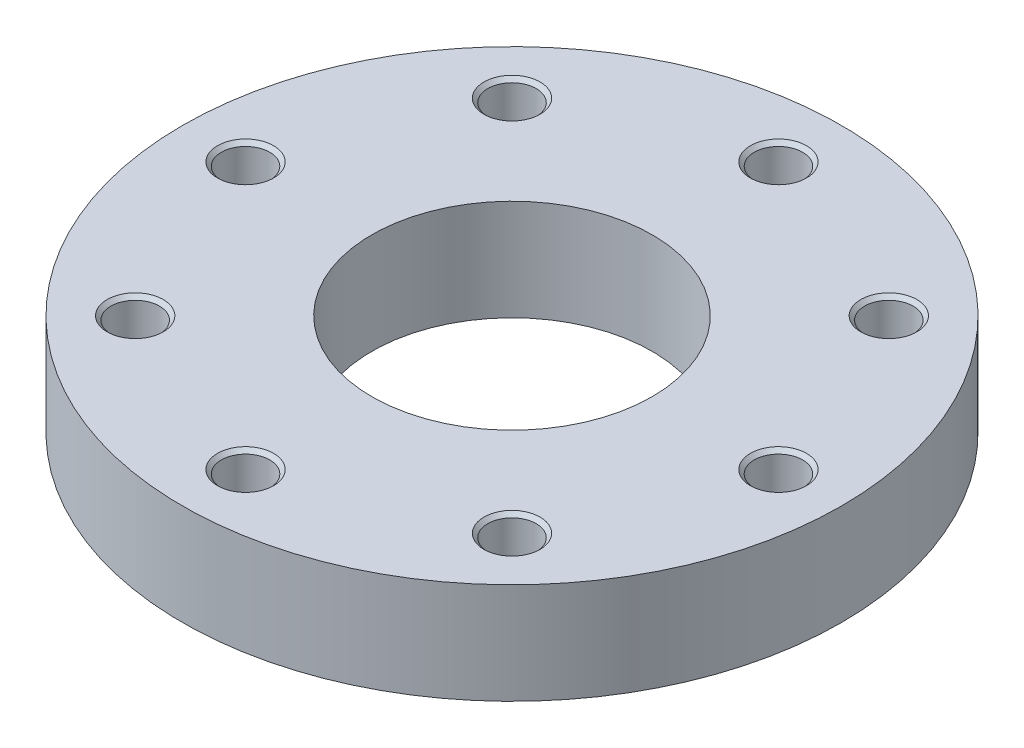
ISO-10303-21;
HEADER;
FILE_DESCRIPTION(('STEP AP214'),'2;1');
FILE_NAME('part.step','',(''),(''),'','','');
FILE_SCHEMA(('AUTOMOTIVE_DESIGN { 1 0 10303 214 1 1 1 1 }'));
ENDSEC;
DATA;
#1=APPLICATION_CONTEXT('core data for automotive mechanical design processes');
#2=APPLICATION_PROTOCOL_DEFINITION('international standard','automotive_design',2000,#1);
#3=PRODUCT_CONTEXT('',#1,'mechanical');
#4=PRODUCT('Part','Part','',(#3));
#5=PRODUCT_RELATED_PRODUCT_CATEGORY('part','',(#4));
#6=PRODUCT_DEFINITION_FORMATION('','',#4);
#7=PRODUCT_DEFINITION_CONTEXT('part definition',#1,'design');
#8=PRODUCT_DEFINITION('design','',#6,#7);
#9=PRODUCT_DEFINITION_SHAPE('','',#8);
#10=(LENGTH_UNIT() NAMED_UNIT(*) SI_UNIT(.MILLI.,.METRE.));
#11=(NAMED_UNIT(*) PLANE_ANGLE_UNIT() SI_UNIT($,.RADIAN.));
#12=(NAMED_UNIT(*) SI_UNIT($,.STERADIAN.) SOLID_ANGLE_UNIT());
#13=UNCERTAINTY_MEASURE_WITH_UNIT(LENGTH_MEASURE(1.E-05),#10,'distance_accuracy_value','');
#14=(GEOMETRIC_REPRESENTATION_CONTEXT(3) GLOBAL_UNCERTAINTY_ASSIGNED_CONTEXT((#13)) GLOBAL_UNIT_ASSIGNED_CONTEXT((#10,
#11,#12)) REPRESENTATION_CONTEXT('',''));
#15=CARTESIAN_POINT('',(0.,0.,0.));
#16=DIRECTION('',(0.,0.,1.));
#17=DIRECTION('',(1.,0.,0.));
#18=AXIS2_PLACEMENT_3D('',#15,#16,#17);
#19=CARTESIAN_POINT('',(0.,18.,0.));
#20=DIRECTION('',(0.,-1.,0.));
#21=DIRECTION('',(1.,0.,0.));
#22=AXIS2_PLACEMENT_3D('',#19,#20,#21);
#23=CYLINDRICAL_SURFACE('',#22,117.5);
#24=CARTESIAN_POINT('',(0.,0.,0.));
#25=DIRECTION('',(0.,1.,0.));
#26=DIRECTION('',(1.,0.,0.));
#27=AXIS2_PLACEMENT_3D('',#24,#25,#26);
#28=CIRCLE('',#27,117.5);
#29=CARTESIAN_POINT('',(117.5,0.,0.));
#30=VERTEX_POINT('',#29);
#31=EDGE_CURVE('E9',#30,#30,#28,.T.);
#32=ORIENTED_EDGE('',*,*,#31,.T.);
#33=EDGE_LOOP('',(#32));
#34=FACE_BOUND('',#33,.T.);
#35=CARTESIAN_POINT('',(0.,36.,0.));
#36=DIRECTION('',(0.,1.,0.));
#37=DIRECTION('',(1.,0.,0.));
#38=AXIS2_PLACEMENT_3D('',#35,#36,#37);
#39=CIRCLE('',#38,117.5);
#40=CARTESIAN_POINT('',(117.5,36.,0.));
#41=VERTEX_POINT('',#40);
#42=EDGE_CURVE('E233',#41,#41,#39,.T.);
#43=ORIENTED_EDGE('',*,*,#42,.F.);
#44=EDGE_LOOP('',(#43));
#45=FACE_BOUND('',#44,.T.);
#46=ADVANCED_FACE('F15',(#34,#45),#23,.T.);
#47=CARTESIAN_POINT('',(83.75,0.,0.));
#48=DIRECTION('',(0.,-1.,0.));
#49=DIRECTION('',(-1.,0.,0.));
#50=AXIS2_PLACEMENT_3D('',#47,#48,#49);
#51=PLANE('',#50);
#52=CARTESIAN_POINT('',(0.,0.,0.));
#53=DIRECTION('',(0.,1.,0.));
#54=DIRECTION('',(1.,0.,0.));
#55=AXIS2_PLACEMENT_3D('',#52,#53,#54);
#56=CIRCLE('',#55,50.);
#57=CARTESIAN_POINT('',(50.,0.,0.));
#58=VERTEX_POINT('',#57);
#59=EDGE_CURVE('E22',#58,#58,#56,.T.);
#60=ORIENTED_EDGE('',*,*,#59,.T.);
#61=EDGE_LOOP('',(#60));
#62=FACE_BOUND('',#61,.T.);
#63=ORIENTED_EDGE('',*,*,#31,.F.);
#64=EDGE_LOOP('',(#63));
#65=FACE_BOUND('',#64,.T.);
#66=ADVANCED_FACE('F225',(#62,#65),#51,.T.);
#67=CARTESIAN_POINT('',(0.,18.,0.));
#68=DIRECTION('',(0.,-1.,0.));
#69=DIRECTION('',(1.,0.,0.));
#70=AXIS2_PLACEMENT_3D('',#67,#68,#69);
#71=CYLINDRICAL_SURFACE('',#70,50.);
#72=CARTESIAN_POINT('',(0.,36.,0.));
#73=DIRECTION('',(0.,1.,0.));
#74=DIRECTION('',(1.,0.,0.));
#75=AXIS2_PLACEMENT_3D('',#72,#73,#74);
#76=CIRCLE('',#75,50.);
#77=CARTESIAN_POINT('',(50.,36.,0.));
#78=VERTEX_POINT('',#77);
#79=EDGE_CURVE('E235',#78,#78,#76,.T.);
#80=ORIENTED_EDGE('',*,*,#79,.T.);
#81=EDGE_LOOP('',(#80));
#82=FACE_BOUND('',#81,.T.);
#83=ORIENTED_EDGE('',*,*,#59,.F.);
#84=EDGE_LOOP('',(#83));
#85=FACE_BOUND('',#84,.T.);
#86=ADVANCED_FACE('F229',(#82,#85),#71,.F.);
#87=CARTESIAN_POINT('',(83.75,36.,0.));
#88=DIRECTION('',(0.,1.,0.));
#89=DIRECTION('',(1.,0.,0.));
#90=AXIS2_PLACEMENT_3D('',#87,#88,#89);
#91=PLANE('',#90);
#92=ORIENTED_EDGE('',*,*,#42,.T.);
#93=EDGE_LOOP('',(#92));
#94=FACE_BOUND('',#93,.T.);
#95=ORIENTED_EDGE('',*,*,#79,.F.);
#96=EDGE_LOOP('',(#95));
#97=FACE_BOUND('',#96,.T.);
#98=CARTESIAN_POINT('',(95.,36.,0.));
#99=DIRECTION('',(0.,-1.,0.));
#100=DIRECTION('',(1.,0.,0.));
#101=AXIS2_PLACEMENT_3D('',#98,#99,#100);
#102=CIRCLE('',#101,10.);
#103=CARTESIAN_POINT('',(105.,36.,0.));
#104=VERTEX_POINT('',#103);
#105=EDGE_CURVE('E245',#104,#104,#102,.T.);
#106=ORIENTED_EDGE('',*,*,#105,.T.);
#107=EDGE_LOOP('',(#106));
#108=FACE_BOUND('',#107,.T.);
#109=CARTESIAN_POINT('',(67.175144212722,36.,-67.175144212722));
#110=DIRECTION('',(0.,-1.,0.));
#111=DIRECTION('',(0.707106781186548,0.,-0.707106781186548));
#112=AXIS2_PLACEMENT_3D('',#109,#110,#111);
#113=CIRCLE('',#112,10.);
#114=CARTESIAN_POINT('',(74.2462120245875,36.,-74.2462120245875));
#115=VERTEX_POINT('',#114);
#116=EDGE_CURVE('E257',#115,#115,#113,.T.);
#117=ORIENTED_EDGE('',*,*,#116,.T.);
#118=EDGE_LOOP('',(#117));
#119=FACE_BOUND('',#118,.T.);
#120=CARTESIAN_POINT('',(0.,36.,-95.));
#121=DIRECTION('',(0.,-1.,0.));
#122=DIRECTION('',(0.,0.,-1.));
#123=AXIS2_PLACEMENT_3D('',#120,#121,#122);
#124=CIRCLE('',#123,10.);
#125=CARTESIAN_POINT('',(0.,36.,-105.));
#126=VERTEX_POINT('',#125);
#127=EDGE_CURVE('E268',#126,#126,#124,.T.);
#128=ORIENTED_EDGE('',*,*,#127,.T.);
#129=EDGE_LOOP('',(#128));
#130=FACE_BOUND('',#129,.T.);
#131=CARTESIAN_POINT('',(-67.175144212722,36.,-67.175144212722));
#132=DIRECTION('',(0.,-1.,0.));
#133=DIRECTION('',(-0.707106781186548,0.,-0.707106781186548));
#134=AXIS2_PLACEMENT_3D('',#131,#132,#133);
#135=CIRCLE('',#134,10.);
#136=CARTESIAN_POINT('',(-74.2462120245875,36.,-74.2462120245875));
#137=VERTEX_POINT('',#136);
#138=EDGE_CURVE('E281',#137,#137,#135,.T.);
#139=ORIENTED_EDGE('',*,*,#138,.T.);
#140=EDGE_LOOP('',(#139));
#141=FACE_BOUND('',#140,.T.);
#142=CARTESIAN_POINT('',(-95.,36.,0.));
#143=DIRECTION('',(0.,-1.,0.));
#144=DIRECTION('',(-1.,0.,0.));
#145=AXIS2_PLACEMENT_3D('',#142,#143,#144);
#146=CIRCLE('',#145,10.);
#147=CARTESIAN_POINT('',(-105.,36.,0.));
#148=VERTEX_POINT('',#147);
#149=EDGE_CURVE('E292',#148,#148,#146,.T.);
#150=ORIENTED_EDGE('',*,*,#149,.T.);
#151=EDGE_LOOP('',(#150));
#152=FACE_BOUND('',#151,.T.);
#153=CARTESIAN_POINT('',(-67.175144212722,36.,67.175144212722));
#154=DIRECTION('',(0.,-1.,0.));
#155=DIRECTION('',(-0.707106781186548,0.,0.707106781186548));
#156=AXIS2_PLACEMENT_3D('',#153,#154,#155);
#157=CIRCLE('',#156,10.);
#158=CARTESIAN_POINT('',(-74.2462120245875,36.,74.2462120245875));
#159=VERTEX_POINT('',#158);
#160=EDGE_CURVE('E315',#159,#159,#157,.T.);
#161=ORIENTED_EDGE('',*,*,#160,.T.);
#162=EDGE_LOOP('',(#161));
#163=FACE_BOUND('',#162,.T.);
#164=CARTESIAN_POINT('',(0.,36.,95.));
#165=DIRECTION('',(0.,-1.,0.));
#166=DIRECTION('',(0.,0.,1.));
#167=AXIS2_PLACEMENT_3D('',#164,#165,#166);
#168=CIRCLE('',#167,10.);
#169=CARTESIAN_POINT('',(0.,36.,105.));
#170=VERTEX_POINT('',#169);
#171=EDGE_CURVE('E310',#170,#170,#168,.T.);
#172=ORIENTED_EDGE('',*,*,#171,.T.);
#173=EDGE_LOOP('',(#172));
#174=FACE_BOUND('',#173,.T.);
#175=CARTESIAN_POINT('',(67.175144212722,36.,67.175144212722));
#176=DIRECTION('',(0.,-1.,0.));
#177=DIRECTION('',(0.707106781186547,0.,0.707106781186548));
#178=AXIS2_PLACEMENT_3D('',#175,#176,#177);
#179=CIRCLE('',#178,10.);
#180=CARTESIAN_POINT('',(74.2462120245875,36.,74.2462120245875));
#181=VERTEX_POINT('',#180);
#182=EDGE_CURVE('E327',#181,#181,#179,.T.);
#183=ORIENTED_EDGE('',*,*,#182,.T.);
#184=EDGE_LOOP('',(#183));
#185=FACE_BOUND('',#184,.T.);
#186=ADVANCED_FACE('F336',(#94,#97,#108,#119,#130,#141,#152,#163,#174,#185),#91,.T.);
#187=CARTESIAN_POINT('',(95.,5.50386219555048,0.));
#188=DIRECTION('',(0.,1.,0.));
#189=DIRECTION('',(1.,0.,0.));
#190=AXIS2_PLACEMENT_3D('',#187,#188,#189);
#191=CONICAL_SURFACE('',#190,4.3234375,1.0471975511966);
#192=CARTESIAN_POINT('',(95.,8.,0.));
#193=DIRECTION('',(0.,-1.,0.));
#194=DIRECTION('',(1.,0.,0.));
#195=AXIS2_PLACEMENT_3D('',#192,#193,#194);
#196=CIRCLE('',#195,8.646875);
#197=CARTESIAN_POINT('',(103.646875,8.,0.));
#198=VERTEX_POINT('',#197);
#199=EDGE_CURVE('E237',#198,#198,#196,.T.);
#200=ORIENTED_EDGE('',*,*,#199,.F.);
#201=EDGE_LOOP('',(#200));
#202=FACE_BOUND('',#201,.T.);
#203=CARTESIAN_POINT('',(95.,3.00772439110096,0.));
#204=VERTEX_POINT('',#203);
#205=VERTEX_LOOP('',#204);
#206=FACE_BOUND('',#205,.T.);
#207=ADVANCED_FACE('F395',(#202,#206),#191,.F.);
#208=CARTESIAN_POINT('',(95.,11.3234375,0.));
#209=DIRECTION('',(0.,1.,0.));
#210=DIRECTION('',(1.,0.,0.));
#211=AXIS2_PLACEMENT_3D('',#208,#209,#210);
#212=CYLINDRICAL_SURFACE('',#211,8.646875);
#213=CARTESIAN_POINT('',(95.,14.646875,0.));
#214=DIRECTION('',(0.,-1.,0.));
#215=DIRECTION('',(1.,0.,0.));
#216=AXIS2_PLACEMENT_3D('',#213,#214,#215);
#217=CIRCLE('',#216,8.646875);
#218=CARTESIAN_POINT('',(103.646875,14.646875,0.));
#219=VERTEX_POINT('',#218);
#220=EDGE_CURVE('E241',#219,#219,#217,.T.);
#221=ORIENTED_EDGE('',*,*,#220,.F.);
#222=EDGE_LOOP('',(#221));
#223=FACE_BOUND('',#222,.T.);
#224=ORIENTED_EDGE('',*,*,#199,.T.);
#225=EDGE_LOOP('',(#224));
#226=FACE_BOUND('',#225,.T.);
#227=ADVANCED_FACE('F392',(#223,#226),#212,.F.);
#228=CARTESIAN_POINT('',(95.,15.3234375,0.));
#229=DIRECTION('',(0.,1.,0.));
#230=DIRECTION('',(1.,0.,0.));
#231=AXIS2_PLACEMENT_3D('',#228,#229,#230);
#232=CONICAL_SURFACE('',#231,9.3234375,0.785398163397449);
#233=CARTESIAN_POINT('',(95.,16.,0.));
#234=DIRECTION('',(0.,-1.,0.));
#235=DIRECTION('',(1.,0.,0.));
#236=AXIS2_PLACEMENT_3D('',#233,#234,#235);
#237=CIRCLE('',#236,10.);
#238=CARTESIAN_POINT('',(105.,16.,0.));
#239=VERTEX_POINT('',#238);
#240=EDGE_CURVE('E242',#239,#239,#237,.T.);
#241=ORIENTED_EDGE('',*,*,#240,.F.);
#242=EDGE_LOOP('',(#241));
#243=FACE_BOUND('',#242,.T.);
#244=ORIENTED_EDGE('',*,*,#220,.T.);
#245=EDGE_LOOP('',(#244));
#246=FACE_BOUND('',#245,.T.);
#247=ADVANCED_FACE('F388',(#243,#246),#232,.F.);
#248=CARTESIAN_POINT('',(104.3234375,16.,0.));
#249=DIRECTION('',(0.,1.,0.));
#250=DIRECTION('',(-1.,0.,0.));
#251=AXIS2_PLACEMENT_3D('',#248,#249,#250);
#252=PLANE('',#251);
#253=CARTESIAN_POINT('',(95.,16.,0.));
#254=DIRECTION('',(0.,-1.,0.));
#255=DIRECTION('',(1.,0.,0.));
#256=AXIS2_PLACEMENT_3D('',#253,#254,#255);
#257=CIRCLE('',#256,8.646875);
#258=CARTESIAN_POINT('',(103.646875,16.,0.));
#259=VERTEX_POINT('',#258);
#260=EDGE_CURVE('E244',#259,#259,#257,.T.);
#261=ORIENTED_EDGE('',*,*,#260,.F.);
#262=EDGE_LOOP('',(#261));
#263=FACE_BOUND('',#262,.T.);
#264=ORIENTED_EDGE('',*,*,#240,.T.);
#265=EDGE_LOOP('',(#264));
#266=FACE_BOUND('',#265,.T.);
#267=ADVANCED_FACE('F384',(#263,#266),#252,.F.);
#268=CARTESIAN_POINT('',(95.,25.3234375,0.));
#269=DIRECTION('',(0.,1.,0.));
#270=DIRECTION('',(1.,0.,0.));
#271=AXIS2_PLACEMENT_3D('',#268,#269,#270);
#272=CYLINDRICAL_SURFACE('',#271,8.646875);
#273=CARTESIAN_POINT('',(95.,34.646875,0.));
#274=DIRECTION('',(0.,-1.,0.));
#275=DIRECTION('',(1.,0.,0.));
#276=AXIS2_PLACEMENT_3D('',#273,#274,#275);
#277=CIRCLE('',#276,8.646875);
#278=CARTESIAN_POINT('',(103.646875,34.646875,0.));
#279=VERTEX_POINT('',#278);
#280=EDGE_CURVE('E247',#279,#279,#277,.T.);
#281=ORIENTED_EDGE('',*,*,#280,.F.);
#282=EDGE_LOOP('',(#281));
#283=FACE_BOUND('',#282,.T.);
#284=ORIENTED_EDGE('',*,*,#260,.T.);
#285=EDGE_LOOP('',(#284));
#286=FACE_BOUND('',#285,.T.);
#287=ADVANCED_FACE('F378',(#283,#286),#272,.F.);
#288=CARTESIAN_POINT('',(95.,35.3234375,0.));
#289=DIRECTION('',(0.,1.,0.));
#290=DIRECTION('',(1.,0.,0.));
#291=AXIS2_PLACEMENT_3D('',#288,#289,#290);
#292=CONICAL_SURFACE('',#291,9.3234375,0.785398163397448);
#293=ORIENTED_EDGE('',*,*,#105,.F.);
#294=EDGE_LOOP('',(#293));
#295=FACE_BOUND('',#294,.T.);
#296=ORIENTED_EDGE('',*,*,#280,.T.);
#297=EDGE_LOOP('',(#296));
#298=FACE_BOUND('',#297,.T.);
#299=ADVANCED_FACE('F373',(#295,#298),#292,.F.);
#300=CARTESIAN_POINT('',(67.175144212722,5.50386219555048,-67.175144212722));
#301=DIRECTION('',(0.,1.,0.));
#302=DIRECTION('',(0.707106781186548,0.,-0.707106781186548));
#303=AXIS2_PLACEMENT_3D('',#300,#301,#302);
#304=CONICAL_SURFACE('',#303,4.3234375,1.0471975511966);
#305=CARTESIAN_POINT('',(67.175144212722,8.,-67.175144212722));
#306=DIRECTION('',(0.,-1.,0.));
#307=DIRECTION('',(0.707106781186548,0.,-0.707106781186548));
#308=AXIS2_PLACEMENT_3D('',#305,#306,#307);
#309=CIRCLE('',#308,8.646875);
#310=CARTESIAN_POINT('',(73.2894081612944,8.,-73.2894081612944));
#311=VERTEX_POINT('',#310);
#312=EDGE_CURVE('E249',#311,#311,#309,.T.);
#313=ORIENTED_EDGE('',*,*,#312,.F.);
#314=EDGE_LOOP('',(#313));
#315=FACE_BOUND('',#314,.T.);
#316=CARTESIAN_POINT('',(67.175144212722,3.00772439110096,-67.175144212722));
#317=VERTEX_POINT('',#316);
#318=VERTEX_LOOP('',#317);
#319=FACE_BOUND('',#318,.T.);
#320=ADVANCED_FACE('F367',(#315,#319),#304,.F.);
#321=CARTESIAN_POINT('',(67.175144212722,11.3234375,-67.175144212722));
#322=DIRECTION('',(0.,1.,0.));
#323=DIRECTION('',(0.707106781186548,0.,-0.707106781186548));
#324=AXIS2_PLACEMENT_3D('',#321,#322,#323);
#325=CYLINDRICAL_SURFACE('',#324,8.646875);
#326=CARTESIAN_POINT('',(67.175144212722,14.646875,-67.175144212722));
#327=DIRECTION('',(0.,-1.,0.));
#328=DIRECTION('',(0.707106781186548,0.,-0.707106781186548));
#329=AXIS2_PLACEMENT_3D('',#326,#327,#328);
#330=CIRCLE('',#329,8.646875);
#331=CARTESIAN_POINT('',(73.2894081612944,14.646875,-73.2894081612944));
#332=VERTEX_POINT('',#331);
#333=EDGE_CURVE('E251',#332,#332,#330,.T.);
#334=ORIENTED_EDGE('',*,*,#333,.F.);
#335=EDGE_LOOP('',(#334));
#336=FACE_BOUND('',#335,.T.);
#337=ORIENTED_EDGE('',*,*,#312,.T.);
#338=EDGE_LOOP('',(#337));
#339=FACE_BOUND('',#338,.T.);
#340=ADVANCED_FACE('F361',(#336,#339),#325,.F.);
#341=CARTESIAN_POINT('',(67.175144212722,15.3234375,-67.175144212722));
#342=DIRECTION('',(0.,1.,0.));
#343=DIRECTION('',(0.707106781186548,0.,-0.707106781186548));
#344=AXIS2_PLACEMENT_3D('',#341,#342,#343);
#345=CONICAL_SURFACE('',#344,9.3234375,0.785398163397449);
#346=CARTESIAN_POINT('',(67.175144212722,16.,-67.175144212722));
#347=DIRECTION('',(0.,-1.,0.));
#348=DIRECTION('',(0.707106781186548,0.,-0.707106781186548));
#349=AXIS2_PLACEMENT_3D('',#346,#347,#348);
#350=CIRCLE('',#349,10.);
#351=CARTESIAN_POINT('',(74.2462120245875,16.,-74.2462120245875));
#352=VERTEX_POINT('',#351);
#353=EDGE_CURVE('E253',#352,#352,#350,.T.);
#354=ORIENTED_EDGE('',*,*,#353,.F.);
#355=EDGE_LOOP('',(#354));
#356=FACE_BOUND('',#355,.T.);
#357=ORIENTED_EDGE('',*,*,#333,.T.);
#358=EDGE_LOOP('',(#357));
#359=FACE_BOUND('',#358,.T.);
#360=ADVANCED_FACE('F355',(#356,#359),#345,.F.);
#361=CARTESIAN_POINT('',(73.767810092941,16.,-73.767810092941));
#362=DIRECTION('',(0.,1.,0.));
#363=DIRECTION('',(-0.707106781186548,0.,0.707106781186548));
#364=AXIS2_PLACEMENT_3D('',#361,#362,#363);
#365=PLANE('',#364);
#366=CARTESIAN_POINT('',(67.175144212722,16.,-67.175144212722));
#367=DIRECTION('',(0.,-1.,0.));
#368=DIRECTION('',(0.707106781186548,0.,-0.707106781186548));
#369=AXIS2_PLACEMENT_3D('',#366,#367,#368);
#370=CIRCLE('',#369,8.646875);
#371=CARTESIAN_POINT('',(73.2894081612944,16.,-73.2894081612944));
#372=VERTEX_POINT('',#371);
#373=EDGE_CURVE('E255',#372,#372,#370,.T.);
#374=ORIENTED_EDGE('',*,*,#373,.F.);
#375=EDGE_LOOP('',(#374));
#376=FACE_BOUND('',#375,.T.);
#377=ORIENTED_EDGE('',*,*,#353,.T.);
#378=EDGE_LOOP('',(#377));
#379=FACE_BOUND('',#378,.T.);
#380=ADVANCED_FACE('F349',(#376,#379),#365,.F.);
#381=CARTESIAN_POINT('',(67.175144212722,25.3234375,-67.175144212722));
#382=DIRECTION('',(0.,1.,0.));
#383=DIRECTION('',(0.707106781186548,0.,-0.707106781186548));
#384=AXIS2_PLACEMENT_3D('',#381,#382,#383);
#385=CYLINDRICAL_SURFACE('',#384,8.646875);
#386=CARTESIAN_POINT('',(67.175144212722,34.646875,-67.175144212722));
#387=DIRECTION('',(0.,-1.,0.));
#388=DIRECTION('',(0.707106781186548,0.,-0.707106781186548));
#389=AXIS2_PLACEMENT_3D('',#386,#387,#388);
#390=CIRCLE('',#389,8.646875);
#391=CARTESIAN_POINT('',(73.2894081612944,34.646875,-73.2894081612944));
#392=VERTEX_POINT('',#391);
#393=EDGE_CURVE('E258',#392,#392,#390,.T.);
#394=ORIENTED_EDGE('',*,*,#393,.F.);
#395=EDGE_LOOP('',(#394));
#396=FACE_BOUND('',#395,.T.);
#397=ORIENTED_EDGE('',*,*,#373,.T.);
#398=EDGE_LOOP('',(#397));
#399=FACE_BOUND('',#398,.T.);
#400=ADVANCED_FACE('F343',(#396,#399),#385,.F.);
#401=CARTESIAN_POINT('',(67.175144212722,35.3234375,-67.175144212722));
#402=DIRECTION('',(0.,1.,0.));
#403=DIRECTION('',(0.707106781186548,0.,-0.707106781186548));
#404=AXIS2_PLACEMENT_3D('',#401,#402,#403);
#405=CONICAL_SURFACE('',#404,9.3234375,0.785398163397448);
#406=ORIENTED_EDGE('',*,*,#116,.F.);
#407=EDGE_LOOP('',(#406));
#408=FACE_BOUND('',#407,.T.);
#409=ORIENTED_EDGE('',*,*,#393,.T.);
#410=EDGE_LOOP('',(#409));
#411=FACE_BOUND('',#410,.T.);
#412=ADVANCED_FACE('F339',(#408,#411),#405,.F.);
#413=CARTESIAN_POINT('',(0.,5.50386219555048,-95.));
#414=DIRECTION('',(0.,1.,0.));
#415=DIRECTION('',(0.,0.,-1.));
#416=AXIS2_PLACEMENT_3D('',#413,#414,#415);
#417=CONICAL_SURFACE('',#416,4.3234375,1.0471975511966);
#418=CARTESIAN_POINT('',(0.,8.,-95.));
#419=DIRECTION('',(0.,-1.,0.));
#420=DIRECTION('',(0.,0.,-1.));
#421=AXIS2_PLACEMENT_3D('',#418,#419,#420);
#422=CIRCLE('',#421,8.646875);
#423=CARTESIAN_POINT('',(0.,8.,-103.646875));
#424=VERTEX_POINT('',#423);
#425=EDGE_CURVE('E260',#424,#424,#422,.T.);
#426=ORIENTED_EDGE('',*,*,#425,.F.);
#427=EDGE_LOOP('',(#426));
#428=FACE_BOUND('',#427,.T.);
#429=CARTESIAN_POINT('',(0.,3.00772439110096,-95.));
#430=VERTEX_POINT('',#429);
#431=VERTEX_LOOP('',#430);
#432=FACE_BOUND('',#431,.T.);
#433=ADVANCED_FACE('F342',(#428,#432),#417,.F.);
#434=CARTESIAN_POINT('',(0.,11.3234375,-95.));
#435=DIRECTION('',(0.,1.,0.));
#436=DIRECTION('',(0.,0.,-1.));
#437=AXIS2_PLACEMENT_3D('',#434,#435,#436);
#438=CYLINDRICAL_SURFACE('',#437,8.646875);
#439=CARTESIAN_POINT('',(0.,14.646875,-95.));
#440=DIRECTION('',(0.,-1.,0.));
#441=DIRECTION('',(0.,0.,-1.));
#442=AXIS2_PLACEMENT_3D('',#439,#440,#441);
#443=CIRCLE('',#442,8.646875);
#444=CARTESIAN_POINT('',(0.,14.646875,-103.646875));
#445=VERTEX_POINT('',#444);
#446=EDGE_CURVE('E262',#445,#445,#443,.T.);
#447=ORIENTED_EDGE('',*,*,#446,.F.);
#448=EDGE_LOOP('',(#447));
#449=FACE_BOUND('',#448,.T.);
#450=ORIENTED_EDGE('',*,*,#425,.T.);
#451=EDGE_LOOP('',(#450));
#452=FACE_BOUND('',#451,.T.);
#453=ADVANCED_FACE('F435',(#449,#452),#438,.F.);
#454=CARTESIAN_POINT('',(0.,15.3234375,-95.));
#455=DIRECTION('',(0.,1.,0.));
#456=DIRECTION('',(0.,0.,-1.));
#457=AXIS2_PLACEMENT_3D('',#454,#455,#456);
#458=CONICAL_SURFACE('',#457,9.3234375,0.785398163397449);
#459=CARTESIAN_POINT('',(0.,16.,-95.));
#460=DIRECTION('',(0.,-1.,0.));
#461=DIRECTION('',(0.,0.,-1.));
#462=AXIS2_PLACEMENT_3D('',#459,#460,#461);
#463=CIRCLE('',#462,10.);
#464=CARTESIAN_POINT('',(0.,16.,-105.));
#465=VERTEX_POINT('',#464);
#466=EDGE_CURVE('E264',#465,#465,#463,.T.);
#467=ORIENTED_EDGE('',*,*,#466,.F.);
#468=EDGE_LOOP('',(#467));
#469=FACE_BOUND('',#468,.T.);
#470=ORIENTED_EDGE('',*,*,#446,.T.);
#471=EDGE_LOOP('',(#470));
#472=FACE_BOUND('',#471,.T.);
#473=ADVANCED_FACE('F430',(#469,#472),#458,.F.);
#474=CARTESIAN_POINT('',(0.,16.,-104.3234375));
#475=DIRECTION('',(0.,1.,0.));
#476=DIRECTION('',(0.,0.,1.));
#477=AXIS2_PLACEMENT_3D('',#474,#475,#476);
#478=PLANE('',#477);
#479=CARTESIAN_POINT('',(0.,16.,-95.));
#480=DIRECTION('',(0.,-1.,0.));
#481=DIRECTION('',(0.,0.,-1.));
#482=AXIS2_PLACEMENT_3D('',#479,#480,#481);
#483=CIRCLE('',#482,8.646875);
#484=CARTESIAN_POINT('',(0.,16.,-103.646875));
#485=VERTEX_POINT('',#484);
#486=EDGE_CURVE('E266',#485,#485,#483,.T.);
#487=ORIENTED_EDGE('',*,*,#486,.F.);
#488=EDGE_LOOP('',(#487));
#489=FACE_BOUND('',#488,.T.);
#490=ORIENTED_EDGE('',*,*,#466,.T.);
#491=EDGE_LOOP('',(#490));
#492=FACE_BOUND('',#491,.T.);
#493=ADVANCED_FACE('F427',(#489,#492),#478,.F.);
#494=CARTESIAN_POINT('',(0.,25.3234375,-95.));
#495=DIRECTION('',(0.,1.,0.));
#496=DIRECTION('',(0.,0.,-1.));
#497=AXIS2_PLACEMENT_3D('',#494,#495,#496);
#498=CYLINDRICAL_SURFACE('',#497,8.646875);
#499=CARTESIAN_POINT('',(0.,34.646875,-95.));
#500=DIRECTION('',(0.,-1.,0.));
#501=DIRECTION('',(0.,0.,-1.));
#502=AXIS2_PLACEMENT_3D('',#499,#500,#501);
#503=CIRCLE('',#502,8.646875);
#504=CARTESIAN_POINT('',(0.,34.646875,-103.646875));
#505=VERTEX_POINT('',#504);
#506=EDGE_CURVE('E270',#505,#505,#503,.T.);
#507=ORIENTED_EDGE('',*,*,#506,.F.);
#508=EDGE_LOOP('',(#507));
#509=FACE_BOUND('',#508,.T.);
#510=ORIENTED_EDGE('',*,*,#486,.T.);
#511=EDGE_LOOP('',(#510));
#512=FACE_BOUND('',#511,.T.);
#513=ADVANCED_FACE('F423',(#509,#512),#498,.F.);
#514=CARTESIAN_POINT('',(0.,35.3234375,-95.));
#515=DIRECTION('',(0.,1.,0.));
#516=DIRECTION('',(0.,0.,-1.));
#517=AXIS2_PLACEMENT_3D('',#514,#515,#516);
#518=CONICAL_SURFACE('',#517,9.3234375,0.785398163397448);
#519=ORIENTED_EDGE('',*,*,#127,.F.);
#520=EDGE_LOOP('',(#519));
#521=FACE_BOUND('',#520,.T.);
#522=ORIENTED_EDGE('',*,*,#506,.T.);
#523=EDGE_LOOP('',(#522));
#524=FACE_BOUND('',#523,.T.);
#525=ADVANCED_FACE('F419',(#521,#524),#518,.F.);
#526=CARTESIAN_POINT('',(-67.175144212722,5.50386219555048,-67.175144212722));
#527=DIRECTION('',(0.,1.,0.));
#528=DIRECTION('',(-0.707106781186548,0.,-0.707106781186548));
#529=AXIS2_PLACEMENT_3D('',#526,#527,#528);
#530=CONICAL_SURFACE('',#529,4.3234375,1.0471975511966);
#531=CARTESIAN_POINT('',(-67.175144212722,8.,-67.175144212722));
#532=DIRECTION('',(0.,-1.,0.));
#533=DIRECTION('',(-0.707106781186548,0.,-0.707106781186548));
#534=AXIS2_PLACEMENT_3D('',#531,#532,#533);
#535=CIRCLE('',#534,8.646875);
#536=CARTESIAN_POINT('',(-73.2894081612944,8.,-73.2894081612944));
#537=VERTEX_POINT('',#536);
#538=EDGE_CURVE('E272',#537,#537,#535,.T.);
#539=ORIENTED_EDGE('',*,*,#538,.F.);
#540=EDGE_LOOP('',(#539));
#541=FACE_BOUND('',#540,.T.);
#542=CARTESIAN_POINT('',(-67.175144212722,3.00772439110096,-67.175144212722));
#543=VERTEX_POINT('',#542);
#544=VERTEX_LOOP('',#543);
#545=FACE_BOUND('',#544,.T.);
#546=ADVANCED_FACE('F416',(#541,#545),#530,.F.);
#547=CARTESIAN_POINT('',(-67.175144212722,11.3234375,-67.175144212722));
#548=DIRECTION('',(0.,1.,0.));
#549=DIRECTION('',(-0.707106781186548,0.,-0.707106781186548));
#550=AXIS2_PLACEMENT_3D('',#547,#548,#549);
#551=CYLINDRICAL_SURFACE('',#550,8.646875);
#552=CARTESIAN_POINT('',(-67.175144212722,14.646875,-67.175144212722));
#553=DIRECTION('',(0.,-1.,0.));
#554=DIRECTION('',(-0.707106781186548,0.,-0.707106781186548));
#555=AXIS2_PLACEMENT_3D('',#552,#553,#554);
#556=CIRCLE('',#555,8.646875);
#557=CARTESIAN_POINT('',(-73.2894081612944,14.646875,-73.2894081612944));
#558=VERTEX_POINT('',#557);
#559=EDGE_CURVE('E275',#558,#558,#556,.T.);
#560=ORIENTED_EDGE('',*,*,#559,.F.);
#561=EDGE_LOOP('',(#560));
#562=FACE_BOUND('',#561,.T.);
#563=ORIENTED_EDGE('',*,*,#538,.T.);
#564=EDGE_LOOP('',(#563));
#565=FACE_BOUND('',#564,.T.);
#566=ADVANCED_FACE('F414',(#562,#565),#551,.F.);
#567=CARTESIAN_POINT('',(-67.175144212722,15.3234375,-67.175144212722));
#568=DIRECTION('',(0.,1.,0.));
#569=DIRECTION('',(-0.707106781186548,0.,-0.707106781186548));
#570=AXIS2_PLACEMENT_3D('',#567,#568,#569);
#571=CONICAL_SURFACE('',#570,9.3234375,0.785398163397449);
#572=CARTESIAN_POINT('',(-67.175144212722,16.,-67.175144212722));
#573=DIRECTION('',(0.,-1.,0.));
#574=DIRECTION('',(-0.707106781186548,0.,-0.707106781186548));
#575=AXIS2_PLACEMENT_3D('',#572,#573,#574);
#576=CIRCLE('',#575,10.);
#577=CARTESIAN_POINT('',(-74.2462120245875,16.,-74.2462120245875));
#578=VERTEX_POINT('',#577);
#579=EDGE_CURVE('E277',#578,#578,#576,.T.);
#580=ORIENTED_EDGE('',*,*,#579,.F.);
#581=EDGE_LOOP('',(#580));
#582=FACE_BOUND('',#581,.T.);
#583=ORIENTED_EDGE('',*,*,#559,.T.);
#584=EDGE_LOOP('',(#583));
#585=FACE_BOUND('',#584,.T.);
#586=ADVANCED_FACE('F481',(#582,#585),#571,.F.);
#587=CARTESIAN_POINT('',(-73.767810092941,16.,-73.767810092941));
#588=DIRECTION('',(0.,1.,0.));
#589=DIRECTION('',(0.707106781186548,0.,0.707106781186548));
#590=AXIS2_PLACEMENT_3D('',#587,#588,#589);
#591=PLANE('',#590);
#592=CARTESIAN_POINT('',(-67.175144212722,16.,-67.175144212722));
#593=DIRECTION('',(0.,-1.,0.));
#594=DIRECTION('',(-0.707106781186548,0.,-0.707106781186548));
#595=AXIS2_PLACEMENT_3D('',#592,#593,#594);
#596=CIRCLE('',#595,8.646875);
#597=CARTESIAN_POINT('',(-73.2894081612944,16.,-73.2894081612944));
#598=VERTEX_POINT('',#597);
#599=EDGE_CURVE('E279',#598,#598,#596,.T.);
#600=ORIENTED_EDGE('',*,*,#599,.F.);
#601=EDGE_LOOP('',(#600));
#602=FACE_BOUND('',#601,.T.);
#603=ORIENTED_EDGE('',*,*,#579,.T.);
#604=EDGE_LOOP('',(#603));
#605=FACE_BOUND('',#604,.T.);
#606=ADVANCED_FACE('F488',(#602,#605),#591,.F.);
#607=CARTESIAN_POINT('',(-67.175144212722,25.3234375,-67.175144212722));
#608=DIRECTION('',(0.,1.,0.));
#609=DIRECTION('',(-0.707106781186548,0.,-0.707106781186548));
#610=AXIS2_PLACEMENT_3D('',#607,#608,#609);
#611=CYLINDRICAL_SURFACE('',#610,8.646875);
#612=CARTESIAN_POINT('',(-67.175144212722,34.646875,-67.175144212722));
#613=DIRECTION('',(0.,-1.,0.));
#614=DIRECTION('',(-0.707106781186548,0.,-0.707106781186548));
#615=AXIS2_PLACEMENT_3D('',#612,#613,#614);
#616=CIRCLE('',#615,8.646875);
#617=CARTESIAN_POINT('',(-73.2894081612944,34.646875,-73.2894081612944));
#618=VERTEX_POINT('',#617);
#619=EDGE_CURVE('E283',#618,#618,#616,.T.);
#620=ORIENTED_EDGE('',*,*,#619,.F.);
#621=EDGE_LOOP('',(#620));
#622=FACE_BOUND('',#621,.T.);
#623=ORIENTED_EDGE('',*,*,#599,.T.);
#624=EDGE_LOOP('',(#623));
#625=FACE_BOUND('',#624,.T.);
#626=ADVANCED_FACE('F495',(#622,#625),#611,.F.);
#627=CARTESIAN_POINT('',(-67.175144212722,35.3234375,-67.175144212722));
#628=DIRECTION('',(0.,1.,0.));
#629=DIRECTION('',(-0.707106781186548,0.,-0.707106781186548));
#630=AXIS2_PLACEMENT_3D('',#627,#628,#629);
#631=CONICAL_SURFACE('',#630,9.3234375,0.785398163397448);
#632=ORIENTED_EDGE('',*,*,#138,.F.);
#633=EDGE_LOOP('',(#632));
#634=FACE_BOUND('',#633,.T.);
#635=ORIENTED_EDGE('',*,*,#619,.T.);
#636=EDGE_LOOP('',(#635));
#637=FACE_BOUND('',#636,.T.);
#638=ADVANCED_FACE('F503',(#634,#637),#631,.F.);
#639=CARTESIAN_POINT('',(-95.,5.50386219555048,0.));
#640=DIRECTION('',(0.,1.,0.));
#641=DIRECTION('',(-1.,0.,0.));
#642=AXIS2_PLACEMENT_3D('',#639,#640,#641);
#643=CONICAL_SURFACE('',#642,4.3234375,1.0471975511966);
#644=CARTESIAN_POINT('',(-95.,8.,0.));
#645=DIRECTION('',(0.,-1.,0.));
#646=DIRECTION('',(-1.,0.,0.));
#647=AXIS2_PLACEMENT_3D('',#644,#645,#646);
#648=CIRCLE('',#647,8.646875);
#649=CARTESIAN_POINT('',(-103.646875,8.,0.));
#650=VERTEX_POINT('',#649);
#651=EDGE_CURVE('E285',#650,#650,#648,.T.);
#652=ORIENTED_EDGE('',*,*,#651,.F.);
#653=EDGE_LOOP('',(#652));
#654=FACE_BOUND('',#653,.T.);
#655=CARTESIAN_POINT('',(-95.,3.00772439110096,0.));
#656=VERTEX_POINT('',#655);
#657=VERTEX_LOOP('',#656);
#658=FACE_BOUND('',#657,.T.);
#659=ADVANCED_FACE('F511',(#654,#658),#643,.F.);
#660=CARTESIAN_POINT('',(-95.,11.3234375,0.));
#661=DIRECTION('',(0.,1.,0.));
#662=DIRECTION('',(-1.,0.,0.));
#663=AXIS2_PLACEMENT_3D('',#660,#661,#662);
#664=CYLINDRICAL_SURFACE('',#663,8.646875);
#665=CARTESIAN_POINT('',(-95.,14.646875,0.));
#666=DIRECTION('',(0.,-1.,0.));
#667=DIRECTION('',(-1.,0.,0.));
#668=AXIS2_PLACEMENT_3D('',#665,#666,#667);
#669=CIRCLE('',#668,8.646875);
#670=CARTESIAN_POINT('',(-103.646875,14.646875,0.));
#671=VERTEX_POINT('',#670);
#672=EDGE_CURVE('E287',#671,#671,#669,.T.);
#673=ORIENTED_EDGE('',*,*,#672,.F.);
#674=EDGE_LOOP('',(#673));
#675=FACE_BOUND('',#674,.T.);
#676=ORIENTED_EDGE('',*,*,#651,.T.);
#677=EDGE_LOOP('',(#676));
#678=FACE_BOUND('',#677,.T.);
#679=ADVANCED_FACE('F519',(#675,#678),#664,.F.);
#680=CARTESIAN_POINT('',(-95.,15.3234375,0.));
#681=DIRECTION('',(0.,1.,0.));
#682=DIRECTION('',(-1.,0.,0.));
#683=AXIS2_PLACEMENT_3D('',#680,#681,#682);
#684=CONICAL_SURFACE('',#683,9.3234375,0.785398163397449);
#685=CARTESIAN_POINT('',(-95.,16.,0.));
#686=DIRECTION('',(0.,-1.,0.));
#687=DIRECTION('',(-1.,0.,0.));
#688=AXIS2_PLACEMENT_3D('',#685,#686,#687);
#689=CIRCLE('',#688,10.);
#690=CARTESIAN_POINT('',(-105.,16.,0.));
#691=VERTEX_POINT('',#690);
#692=EDGE_CURVE('E288',#691,#691,#689,.T.);
#693=ORIENTED_EDGE('',*,*,#692,.F.);
#694=EDGE_LOOP('',(#693));
#695=FACE_BOUND('',#694,.T.);
#696=ORIENTED_EDGE('',*,*,#672,.T.);
#697=EDGE_LOOP('',(#696));
#698=FACE_BOUND('',#697,.T.);
#699=ADVANCED_FACE('F527',(#695,#698),#684,.F.);
#700=CARTESIAN_POINT('',(-104.3234375,16.,0.));
#701=DIRECTION('',(0.,1.,0.));
#702=DIRECTION('',(1.,0.,0.));
#703=AXIS2_PLACEMENT_3D('',#700,#701,#702);
#704=PLANE('',#703);
#705=CARTESIAN_POINT('',(-95.,16.,0.));
#706=DIRECTION('',(0.,-1.,0.));
#707=DIRECTION('',(-1.,0.,0.));
#708=AXIS2_PLACEMENT_3D('',#705,#706,#707);
#709=CIRCLE('',#708,8.646875);
#710=CARTESIAN_POINT('',(-103.646875,16.,0.));
#711=VERTEX_POINT('',#710);
#712=EDGE_CURVE('E290',#711,#711,#709,.T.);
#713=ORIENTED_EDGE('',*,*,#712,.F.);
#714=EDGE_LOOP('',(#713));
#715=FACE_BOUND('',#714,.T.);
#716=ORIENTED_EDGE('',*,*,#692,.T.);
#717=EDGE_LOOP('',(#716));
#718=FACE_BOUND('',#717,.T.);
#719=ADVANCED_FACE('F535',(#715,#718),#704,.F.);
#720=CARTESIAN_POINT('',(-95.,25.3234375,0.));
#721=DIRECTION('',(0.,1.,0.));
#722=DIRECTION('',(-1.,0.,0.));
#723=AXIS2_PLACEMENT_3D('',#720,#721,#722);
#724=CYLINDRICAL_SURFACE('',#723,8.646875);
#725=CARTESIAN_POINT('',(-95.,34.646875,0.));
#726=DIRECTION('',(0.,-1.,0.));
#727=DIRECTION('',(-1.,0.,0.));
#728=AXIS2_PLACEMENT_3D('',#725,#726,#727);
#729=CIRCLE('',#728,8.646875);
#730=CARTESIAN_POINT('',(-103.646875,34.646875,0.));
#731=VERTEX_POINT('',#730);
#732=EDGE_CURVE('E294',#731,#731,#729,.T.);
#733=ORIENTED_EDGE('',*,*,#732,.F.);
#734=EDGE_LOOP('',(#733));
#735=FACE_BOUND('',#734,.T.);
#736=ORIENTED_EDGE('',*,*,#712,.T.);
#737=EDGE_LOOP('',(#736));
#738=FACE_BOUND('',#737,.T.);
#739=ADVANCED_FACE('F543',(#735,#738),#724,.F.);
#740=CARTESIAN_POINT('',(-95.,35.3234375,0.));
#741=DIRECTION('',(0.,1.,0.));
#742=DIRECTION('',(-1.,0.,0.));
#743=AXIS2_PLACEMENT_3D('',#740,#741,#742);
#744=CONICAL_SURFACE('',#743,9.3234375,0.785398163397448);
#745=ORIENTED_EDGE('',*,*,#149,.F.);
#746=EDGE_LOOP('',(#745));
#747=FACE_BOUND('',#746,.T.);
#748=ORIENTED_EDGE('',*,*,#732,.T.);
#749=EDGE_LOOP('',(#748));
#750=FACE_BOUND('',#749,.T.);
#751=ADVANCED_FACE('F551',(#747,#750),#744,.F.);
#752=CARTESIAN_POINT('',(-67.175144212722,5.50386219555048,67.175144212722));
#753=DIRECTION('',(0.,1.,0.));
#754=DIRECTION('',(-0.707106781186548,0.,0.707106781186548));
#755=AXIS2_PLACEMENT_3D('',#752,#753,#754);
#756=CONICAL_SURFACE('',#755,4.3234375,1.0471975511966);
#757=CARTESIAN_POINT('',(-67.175144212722,8.,67.175144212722));
#758=DIRECTION('',(0.,-1.,0.));
#759=DIRECTION('',(-0.707106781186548,0.,0.707106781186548));
#760=AXIS2_PLACEMENT_3D('',#757,#758,#759);
#761=CIRCLE('',#760,8.646875);
#762=CARTESIAN_POINT('',(-73.2894081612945,8.,73.2894081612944));
#763=VERTEX_POINT('',#762);
#764=EDGE_CURVE('E296',#763,#763,#761,.T.);
#765=ORIENTED_EDGE('',*,*,#764,.F.);
#766=EDGE_LOOP('',(#765));
#767=FACE_BOUND('',#766,.T.);
#768=CARTESIAN_POINT('',(-67.175144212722,3.00772439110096,67.175144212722));
#769=VERTEX_POINT('',#768);
#770=VERTEX_LOOP('',#769);
#771=FACE_BOUND('',#770,.T.);
#772=ADVANCED_FACE('F559',(#767,#771),#756,.F.);
#773=CARTESIAN_POINT('',(-67.175144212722,11.3234375,67.175144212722));
#774=DIRECTION('',(0.,1.,0.));
#775=DIRECTION('',(-0.707106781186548,0.,0.707106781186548));
#776=AXIS2_PLACEMENT_3D('',#773,#774,#775);
#777=CYLINDRICAL_SURFACE('',#776,8.646875);
#778=CARTESIAN_POINT('',(-67.175144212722,14.646875,67.175144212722));
#779=DIRECTION('',(0.,-1.,0.));
#780=DIRECTION('',(-0.707106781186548,0.,0.707106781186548));
#781=AXIS2_PLACEMENT_3D('',#778,#779,#780);
#782=CIRCLE('',#781,8.646875);
#783=CARTESIAN_POINT('',(-73.2894081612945,14.646875,73.2894081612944));
#784=VERTEX_POINT('',#783);
#785=EDGE_CURVE('E298',#784,#784,#782,.T.);
#786=ORIENTED_EDGE('',*,*,#785,.F.);
#787=EDGE_LOOP('',(#786));
#788=FACE_BOUND('',#787,.T.);
#789=ORIENTED_EDGE('',*,*,#764,.T.);
#790=EDGE_LOOP('',(#789));
#791=FACE_BOUND('',#790,.T.);
#792=ADVANCED_FACE('F567',(#788,#791),#777,.F.);
#793=CARTESIAN_POINT('',(-67.175144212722,15.3234375,67.175144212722));
#794=DIRECTION('',(0.,1.,0.));
#795=DIRECTION('',(-0.707106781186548,0.,0.707106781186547));
#796=AXIS2_PLACEMENT_3D('',#793,#794,#795);
#797=CONICAL_SURFACE('',#796,9.3234375,0.785398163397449);
#798=CARTESIAN_POINT('',(-67.175144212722,16.,67.175144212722));
#799=DIRECTION('',(0.,-1.,0.));
#800=DIRECTION('',(-0.707106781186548,0.,0.707106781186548));
#801=AXIS2_PLACEMENT_3D('',#798,#799,#800);
#802=CIRCLE('',#801,10.);
#803=CARTESIAN_POINT('',(-74.2462120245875,16.,74.2462120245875));
#804=VERTEX_POINT('',#803);
#805=EDGE_CURVE('E300',#804,#804,#802,.T.);
#806=ORIENTED_EDGE('',*,*,#805,.F.);
#807=EDGE_LOOP('',(#806));
#808=FACE_BOUND('',#807,.T.);
#809=ORIENTED_EDGE('',*,*,#785,.T.);
#810=EDGE_LOOP('',(#809));
#811=FACE_BOUND('',#810,.T.);
#812=ADVANCED_FACE('F575',(#808,#811),#797,.F.);
#813=CARTESIAN_POINT('',(-73.767810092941,16.,73.767810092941));
#814=DIRECTION('',(0.,1.,0.));
#815=DIRECTION('',(0.707106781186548,0.,-0.707106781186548));
#816=AXIS2_PLACEMENT_3D('',#813,#814,#815);
#817=PLANE('',#816);
#818=CARTESIAN_POINT('',(-67.175144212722,16.,67.175144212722));
#819=DIRECTION('',(0.,-1.,0.));
#820=DIRECTION('',(-0.707106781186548,0.,0.707106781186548));
#821=AXIS2_PLACEMENT_3D('',#818,#819,#820);
#822=CIRCLE('',#821,8.646875);
#823=CARTESIAN_POINT('',(-73.2894081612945,16.,73.2894081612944));
#824=VERTEX_POINT('',#823);
#825=EDGE_CURVE('E302',#824,#824,#822,.T.);
#826=ORIENTED_EDGE('',*,*,#825,.F.);
#827=EDGE_LOOP('',(#826));
#828=FACE_BOUND('',#827,.T.);
#829=ORIENTED_EDGE('',*,*,#805,.T.);
#830=EDGE_LOOP('',(#829));
#831=FACE_BOUND('',#830,.T.);
#832=ADVANCED_FACE('F583',(#828,#831),#817,.F.);
#833=CARTESIAN_POINT('',(-67.175144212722,25.3234375,67.175144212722));
#834=DIRECTION('',(0.,1.,0.));
#835=DIRECTION('',(-0.707106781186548,0.,0.707106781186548));
#836=AXIS2_PLACEMENT_3D('',#833,#834,#835);
#837=CYLINDRICAL_SURFACE('',#836,8.646875);
#838=CARTESIAN_POINT('',(-67.175144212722,34.646875,67.175144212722));
#839=DIRECTION('',(0.,-1.,0.));
#840=DIRECTION('',(-0.707106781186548,0.,0.707106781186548));
#841=AXIS2_PLACEMENT_3D('',#838,#839,#840);
#842=CIRCLE('',#841,8.646875);
#843=CARTESIAN_POINT('',(-73.2894081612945,34.646875,73.2894081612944));
#844=VERTEX_POINT('',#843);
#845=EDGE_CURVE('E314',#844,#844,#842,.T.);
#846=ORIENTED_EDGE('',*,*,#845,.F.);
#847=EDGE_LOOP('',(#846));
#848=FACE_BOUND('',#847,.T.);
#849=ORIENTED_EDGE('',*,*,#825,.T.);
#850=EDGE_LOOP('',(#849));
#851=FACE_BOUND('',#850,.T.);
#852=ADVANCED_FACE('F218',(#848,#851),#837,.F.);
#853=CARTESIAN_POINT('',(-67.175144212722,35.3234375,67.175144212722));
#854=DIRECTION('',(0.,1.,0.));
#855=DIRECTION('',(-0.707106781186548,0.,0.707106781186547));
#856=AXIS2_PLACEMENT_3D('',#853,#854,#855);
#857=CONICAL_SURFACE('',#856,9.3234375,0.785398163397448);
#858=ORIENTED_EDGE('',*,*,#160,.F.);
#859=EDGE_LOOP('',(#858));
#860=FACE_BOUND('',#859,.T.);
#861=ORIENTED_EDGE('',*,*,#845,.T.);
#862=EDGE_LOOP('',(#861));
#863=FACE_BOUND('',#862,.T.);
#864=ADVANCED_FACE('F207',(#860,#863),#857,.F.);
#865=CARTESIAN_POINT('',(0.,5.50386219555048,95.));
#866=DIRECTION('',(0.,1.,0.));
#867=DIRECTION('',(0.,0.,1.));
#868=AXIS2_PLACEMENT_3D('',#865,#866,#867);
#869=CONICAL_SURFACE('',#868,4.3234375,1.0471975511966);
#870=CARTESIAN_POINT('',(0.,8.,95.));
#871=DIRECTION('',(0.,-1.,0.));
#872=DIRECTION('',(0.,0.,1.));
#873=AXIS2_PLACEMENT_3D('',#870,#871,#872);
#874=CIRCLE('',#873,8.646875);
#875=CARTESIAN_POINT('',(0.,8.,103.646875));
#876=VERTEX_POINT('',#875);
#877=EDGE_CURVE('E312',#876,#876,#874,.T.);
#878=ORIENTED_EDGE('',*,*,#877,.F.);
#879=EDGE_LOOP('',(#878));
#880=FACE_BOUND('',#879,.T.);
#881=CARTESIAN_POINT('',(0.,3.00772439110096,95.));
#882=VERTEX_POINT('',#881);
#883=VERTEX_LOOP('',#882);
#884=FACE_BOUND('',#883,.T.);
#885=ADVANCED_FACE('F204',(#880,#884),#869,.F.);
#886=CARTESIAN_POINT('',(0.,11.3234375,95.));
#887=DIRECTION('',(0.,1.,0.));
#888=DIRECTION('',(0.,0.,1.));
#889=AXIS2_PLACEMENT_3D('',#886,#887,#888);
#890=CYLINDRICAL_SURFACE('',#889,8.646875);
#891=CARTESIAN_POINT('',(0.,14.646875,95.));
#892=DIRECTION('',(0.,-1.,0.));
#893=DIRECTION('',(0.,0.,1.));
#894=AXIS2_PLACEMENT_3D('',#891,#892,#893);
#895=CIRCLE('',#894,8.646875);
#896=CARTESIAN_POINT('',(0.,14.646875,103.646875));
#897=VERTEX_POINT('',#896);
#898=EDGE_CURVE('E305',#897,#897,#895,.T.);
#899=ORIENTED_EDGE('',*,*,#898,.F.);
#900=EDGE_LOOP('',(#899));
#901=FACE_BOUND('',#900,.T.);
#902=ORIENTED_EDGE('',*,*,#877,.T.);
#903=EDGE_LOOP('',(#902));
#904=FACE_BOUND('',#903,.T.);
#905=ADVANCED_FACE('F206',(#901,#904),#890,.F.);
#906=CARTESIAN_POINT('',(0.,15.3234375,95.));
#907=DIRECTION('',(0.,1.,0.));
#908=DIRECTION('',(0.,0.,1.));
#909=AXIS2_PLACEMENT_3D('',#906,#907,#908);
#910=CONICAL_SURFACE('',#909,9.3234375,0.785398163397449);
#911=CARTESIAN_POINT('',(0.,16.,95.));
#912=DIRECTION('',(0.,-1.,0.));
#913=DIRECTION('',(0.,0.,1.));
#914=AXIS2_PLACEMENT_3D('',#911,#912,#913);
#915=CIRCLE('',#914,10.);
#916=CARTESIAN_POINT('',(0.,16.,105.));
#917=VERTEX_POINT('',#916);
#918=EDGE_CURVE('E303',#917,#917,#915,.T.);
#919=ORIENTED_EDGE('',*,*,#918,.F.);
#920=EDGE_LOOP('',(#919));
#921=FACE_BOUND('',#920,.T.);
#922=ORIENTED_EDGE('',*,*,#898,.T.);
#923=EDGE_LOOP('',(#922));
#924=FACE_BOUND('',#923,.T.);
#925=ADVANCED_FACE('F215',(#921,#924),#910,.F.);
#926=CARTESIAN_POINT('',(0.,16.,104.3234375));
#927=DIRECTION('',(0.,1.,0.));
#928=DIRECTION('',(0.,0.,-1.));
#929=AXIS2_PLACEMENT_3D('',#926,#927,#928);
#930=PLANE('',#929);
#931=CARTESIAN_POINT('',(0.,16.,95.));
#932=DIRECTION('',(0.,-1.,0.));
#933=DIRECTION('',(0.,0.,1.));
#934=AXIS2_PLACEMENT_3D('',#931,#932,#933);
#935=CIRCLE('',#934,8.646875);
#936=CARTESIAN_POINT('',(0.,16.,103.646875));
#937=VERTEX_POINT('',#936);
#938=EDGE_CURVE('E306',#937,#937,#935,.T.);
#939=ORIENTED_EDGE('',*,*,#938,.F.);
#940=EDGE_LOOP('',(#939));
#941=FACE_BOUND('',#940,.T.);
#942=ORIENTED_EDGE('',*,*,#918,.T.);
#943=EDGE_LOOP('',(#942));
#944=FACE_BOUND('',#943,.T.);
#945=ADVANCED_FACE('F625',(#941,#944),#930,.F.);
#946=CARTESIAN_POINT('',(0.,25.3234375,95.));
#947=DIRECTION('',(0.,1.,0.));
#948=DIRECTION('',(0.,0.,1.));
#949=AXIS2_PLACEMENT_3D('',#946,#947,#948);
#950=CYLINDRICAL_SURFACE('',#949,8.646875);
#951=CARTESIAN_POINT('',(0.,34.646875,95.));
#952=DIRECTION('',(0.,-1.,0.));
#953=DIRECTION('',(0.,0.,1.));
#954=AXIS2_PLACEMENT_3D('',#951,#952,#953);
#955=CIRCLE('',#954,8.646875);
#956=CARTESIAN_POINT('',(0.,34.646875,103.646875));
#957=VERTEX_POINT('',#956);
#958=EDGE_CURVE('E308',#957,#957,#955,.T.);
#959=ORIENTED_EDGE('',*,*,#958,.F.);
#960=EDGE_LOOP('',(#959));
#961=FACE_BOUND('',#960,.T.);
#962=ORIENTED_EDGE('',*,*,#938,.T.);
#963=EDGE_LOOP('',(#962));
#964=FACE_BOUND('',#963,.T.);
#965=ADVANCED_FACE('F635',(#961,#964),#950,.F.);
#966=CARTESIAN_POINT('',(0.,35.3234375,95.));
#967=DIRECTION('',(0.,1.,0.));
#968=DIRECTION('',(0.,0.,1.));
#969=AXIS2_PLACEMENT_3D('',#966,#967,#968);
#970=CONICAL_SURFACE('',#969,9.3234375,0.785398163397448);
#971=ORIENTED_EDGE('',*,*,#171,.F.);
#972=EDGE_LOOP('',(#971));
#973=FACE_BOUND('',#972,.T.);
#974=ORIENTED_EDGE('',*,*,#958,.T.);
#975=EDGE_LOOP('',(#974));
#976=FACE_BOUND('',#975,.T.);
#977=ADVANCED_FACE('F645',(#973,#976),#970,.F.);
#978=CARTESIAN_POINT('',(67.175144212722,5.50386219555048,67.175144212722));
#979=DIRECTION('',(0.,1.,0.));
#980=DIRECTION('',(0.707106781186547,0.,0.707106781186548));
#981=AXIS2_PLACEMENT_3D('',#978,#979,#980);
#982=CONICAL_SURFACE('',#981,4.3234375,1.0471975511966);
#983=CARTESIAN_POINT('',(67.175144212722,8.,67.175144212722));
#984=DIRECTION('',(0.,-1.,0.));
#985=DIRECTION('',(0.707106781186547,0.,0.707106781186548));
#986=AXIS2_PLACEMENT_3D('',#983,#984,#985);
#987=CIRCLE('',#986,8.646875);
#988=CARTESIAN_POINT('',(73.2894081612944,8.,73.2894081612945));
#989=VERTEX_POINT('',#988);
#990=EDGE_CURVE('E311',#989,#989,#987,.T.);
#991=ORIENTED_EDGE('',*,*,#990,.F.);
#992=EDGE_LOOP('',(#991));
#993=FACE_BOUND('',#992,.T.);
#994=CARTESIAN_POINT('',(67.175144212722,3.00772439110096,67.175144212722));
#995=VERTEX_POINT('',#994);
#996=VERTEX_LOOP('',#995);
#997=FACE_BOUND('',#996,.T.);
#998=ADVANCED_FACE('F655',(#993,#997),#982,.F.);
#999=CARTESIAN_POINT('',(67.175144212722,11.3234375,67.175144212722));
#1000=DIRECTION('',(0.,1.,0.));
#1001=DIRECTION('',(0.707106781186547,0.,0.707106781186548));
#1002=AXIS2_PLACEMENT_3D('',#999,#1000,#1001);
#1003=CYLINDRICAL_SURFACE('',#1002,8.646875);
#1004=CARTESIAN_POINT('',(67.175144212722,14.646875,67.175144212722));
#1005=DIRECTION('',(0.,-1.,0.));
#1006=DIRECTION('',(0.707106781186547,0.,0.707106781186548));
#1007=AXIS2_PLACEMENT_3D('',#1004,#1005,#1006);
#1008=CIRCLE('',#1007,8.646875);
#1009=CARTESIAN_POINT('',(73.2894081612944,14.646875,73.2894081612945));
#1010=VERTEX_POINT('',#1009);
#1011=EDGE_CURVE('E318',#1010,#1010,#1008,.T.);
#1012=ORIENTED_EDGE('',*,*,#1011,.F.);
#1013=EDGE_LOOP('',(#1012));
#1014=FACE_BOUND('',#1013,.T.);
#1015=ORIENTED_EDGE('',*,*,#990,.T.);
#1016=EDGE_LOOP('',(#1015));
#1017=FACE_BOUND('',#1016,.T.);
#1018=ADVANCED_FACE('F665',(#1014,#1017),#1003,.F.);
#1019=CARTESIAN_POINT('',(67.175144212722,15.3234375,67.175144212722));
#1020=DIRECTION('',(0.,1.,0.));
#1021=DIRECTION('',(0.707106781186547,0.,0.707106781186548));
#1022=AXIS2_PLACEMENT_3D('',#1019,#1020,#1021);
#1023=CONICAL_SURFACE('',#1022,9.3234375,0.785398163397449);
#1024=CARTESIAN_POINT('',(67.175144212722,16.,67.175144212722));
#1025=DIRECTION('',(0.,-1.,0.));
#1026=DIRECTION('',(0.707106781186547,0.,0.707106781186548));
#1027=AXIS2_PLACEMENT_3D('',#1024,#1025,#1026);
#1028=CIRCLE('',#1027,10.);
#1029=CARTESIAN_POINT('',(74.2462120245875,16.,74.2462120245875));
#1030=VERTEX_POINT('',#1029);
#1031=EDGE_CURVE('E321',#1030,#1030,#1028,.T.);
#1032=ORIENTED_EDGE('',*,*,#1031,.F.);
#1033=EDGE_LOOP('',(#1032));
#1034=FACE_BOUND('',#1033,.T.);
#1035=ORIENTED_EDGE('',*,*,#1011,.T.);
#1036=EDGE_LOOP('',(#1035));
#1037=FACE_BOUND('',#1036,.T.);
#1038=ADVANCED_FACE('F675',(#1034,#1037),#1023,.F.);
#1039=CARTESIAN_POINT('',(73.7678100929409,16.,73.767810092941));
#1040=DIRECTION('',(0.,1.,0.));
#1041=DIRECTION('',(-0.707106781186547,0.,-0.707106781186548));
#1042=AXIS2_PLACEMENT_3D('',#1039,#1040,#1041);
#1043=PLANE('',#1042);
#1044=CARTESIAN_POINT('',(67.175144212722,16.,67.175144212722));
#1045=DIRECTION('',(0.,-1.,0.));
#1046=DIRECTION('',(0.707106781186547,0.,0.707106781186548));
#1047=AXIS2_PLACEMENT_3D('',#1044,#1045,#1046);
#1048=CIRCLE('',#1047,8.646875);
#1049=CARTESIAN_POINT('',(73.2894081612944,16.,73.2894081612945));
#1050=VERTEX_POINT('',#1049);
#1051=EDGE_CURVE('E324',#1050,#1050,#1048,.T.);
#1052=ORIENTED_EDGE('',*,*,#1051,.F.);
#1053=EDGE_LOOP('',(#1052));
#1054=FACE_BOUND('',#1053,.T.);
#1055=ORIENTED_EDGE('',*,*,#1031,.T.);
#1056=EDGE_LOOP('',(#1055));
#1057=FACE_BOUND('',#1056,.T.);
#1058=ADVANCED_FACE('F685',(#1054,#1057),#1043,.F.);
#1059=CARTESIAN_POINT('',(67.175144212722,25.3234375,67.175144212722));
#1060=DIRECTION('',(0.,1.,0.));
#1061=DIRECTION('',(0.707106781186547,0.,0.707106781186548));
#1062=AXIS2_PLACEMENT_3D('',#1059,#1060,#1061);
#1063=CYLINDRICAL_SURFACE('',#1062,8.646875);
#1064=CARTESIAN_POINT('',(67.175144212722,34.646875,67.175144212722));
#1065=DIRECTION('',(0.,-1.,0.));
#1066=DIRECTION('',(0.707106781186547,0.,0.707106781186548));
#1067=AXIS2_PLACEMENT_3D('',#1064,#1065,#1066);
#1068=CIRCLE('',#1067,8.646875);
#1069=CARTESIAN_POINT('',(73.2894081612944,34.646875,73.2894081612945));
#1070=VERTEX_POINT('',#1069);
#1071=EDGE_CURVE('E331',#1070,#1070,#1068,.T.);
#1072=ORIENTED_EDGE('',*,*,#1071,.F.);
#1073=EDGE_LOOP('',(#1072));
#1074=FACE_BOUND('',#1073,.T.);
#1075=ORIENTED_EDGE('',*,*,#1051,.T.);
#1076=EDGE_LOOP('',(#1075));
#1077=FACE_BOUND('',#1076,.T.);
#1078=ADVANCED_FACE('F695',(#1074,#1077),#1063,.F.);
#1079=CARTESIAN_POINT('',(67.175144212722,35.3234375,67.175144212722));
#1080=DIRECTION('',(0.,1.,0.));
#1081=DIRECTION('',(0.707106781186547,0.,0.707106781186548));
#1082=AXIS2_PLACEMENT_3D('',#1079,#1080,#1081);
#1083=CONICAL_SURFACE('',#1082,9.3234375,0.785398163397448);
#1084=ORIENTED_EDGE('',*,*,#182,.F.);
#1085=EDGE_LOOP('',(#1084));
#1086=FACE_BOUND('',#1085,.T.);
#1087=ORIENTED_EDGE('',*,*,#1071,.T.);
#1088=EDGE_LOOP('',(#1087));
#1089=FACE_BOUND('',#1088,.T.);
#1090=ADVANCED_FACE('F705',(#1086,#1089),#1083,.F.);
#1091=CLOSED_SHELL('',(#46,#66,#86,#186,#207,#227,#247,#267,#287,#299,#320,#340,#360,#380,#400,
#412,#433,#453,#473,#493,#513,#525,#546,#566,#586,#606,#626,#638,#659,#679,#699,#719,#739,#751,
#772,#792,#812,#832,#852,#864,#885,#905,#925,#945,#965,#977,#998,#1018,#1038,#1058,#1078,#1090));
#1092=MANIFOLD_SOLID_BREP('B1',#1091);
#1093=ADVANCED_BREP_SHAPE_REPRESENTATION('',(#18,#1092),#14);
#1094=SHAPE_DEFINITION_REPRESENTATION(#9,#1093);
ENDSEC;
END-ISO-10303-21;
